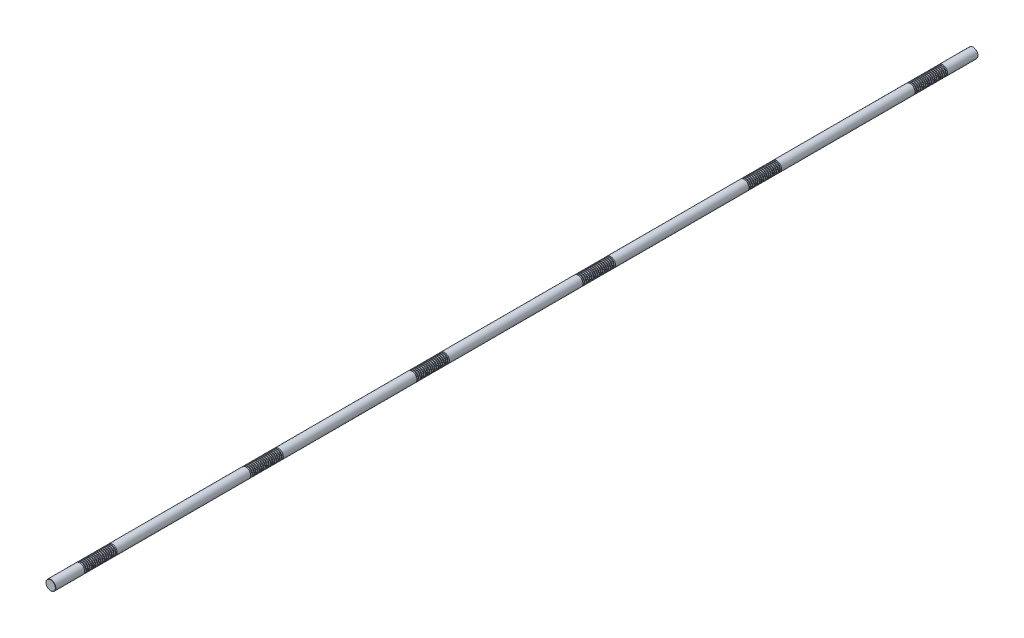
from build123d import *

# Parameters (mm, degrees)
SKETCH1_R           = 16
BOSS_EXTRUDE1_DEPTH = 1500
CHAMFER1_SIZE       = 0.8
LPATTERN1_COUNT     = 18
LPATTERN1_PITCH     = 6
LPATTERN2_COUNT     = 6
LPATTERN2_PITCH     = 540


with BuildPart() as part:
    # Sketch1 → Boss-Extrude1 (new, symmetric)
    with BuildSketch(Plane.XY):
        Circle(SKETCH1_R)
    extrude(amount=BOSS_EXTRUDE1_DEPTH, both=True)

    # Chamfer1
    chamfer1_edges = [part.edges().sort_by_distance(p)[0] for p in [
        (-16, 0, -1500),
        (-16, 0, 1500),
    ]]
    chamfer(chamfer1_edges, length=CHAMFER1_SIZE)

    # Sketch2 → Cut-Revolve1 (revolve, cut)
    with BuildSketch(Plane(origin=(0, 0, 0), x_dir=(0, 0, -1), z_dir=(1, 0, 0)), mode=Mode.PRIVATE) as cut_revolve1_sk:
        Polygon((1400.468911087, 16), (1396.531088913, 16), (1397.468911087, 12.5), (1399.531088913, 12.5), align=None)
    cut_revolve1 = revolve(cut_revolve1_sk.sketch.rotate(Axis((0, 0, 1500), (0, 0, -1)), 90), axis=Axis((0, 0, 1500), (0, 0, -1)), mode=Mode.SUBTRACT)

    # LPattern1: Cut-Revolve1 ×18
    with Locations(*[(0, 0, i * LPATTERN1_PITCH) for i in range(1, LPATTERN1_COUNT)]):
        add(cut_revolve1, mode=Mode.SUBTRACT)

    # LPattern2: Cut-Revolve1 ×6
    with Locations(*[(0, 0, i * LPATTERN2_PITCH) for i in range(1, LPATTERN2_COUNT)]):
        add(cut_revolve1, mode=Mode.SUBTRACT)

    # LPattern2 copy 1 sketch → LPattern2 copy 1 (revolve, cut)
    with BuildSketch(Plane(origin=(0, 0, 546), x_dir=(0, 0, -1), z_dir=(1, 0, 0))):
        Polygon((1400.468911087, 16), (1396.531088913, 16), (1397.468911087, 12.5), (1399.531088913, 12.5), align=None)
    revolve(axis=Axis((0, 0, 2046), (0, 0, -1)), mode=Mode.SUBTRACT)

    # LPattern2 copy 2 sketch → LPattern2 copy 2 (revolve, cut)
    with BuildSketch(Plane(origin=(0, 0, 1086), x_dir=(0, 0, -1), z_dir=(1, 0, 0))):
        Polygon((1400.468911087, 16), (1396.531088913, 16), (1397.468911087, 12.5), (1399.531088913, 12.5), align=None)
    revolve(axis=Axis((0, 0, 2586), (0, 0, -1)), mode=Mode.SUBTRACT)

    # LPattern2 copy 3 sketch → LPattern2 copy 3 (revolve, cut)
    with BuildSketch(Plane(origin=(0, 0, 1626), x_dir=(0, 0, -1), z_dir=(1, 0, 0))):
        Polygon((1400.468911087, 16), (1396.531088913, 16), (1397.468911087, 12.5), (1399.531088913, 12.5), align=None)
    revolve(axis=Axis((0, 0, 3126), (0, 0, -1)), mode=Mode.SUBTRACT)

    # LPattern2 copy 4 sketch → LPattern2 copy 4 (revolve, cut)
    with BuildSketch(Plane(origin=(0, 0, 2166), x_dir=(0, 0, -1), z_dir=(1, 0, 0))):
        Polygon((1400.468911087, 16), (1396.531088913, 16), (1397.468911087, 12.5), (1399.531088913, 12.5), align=None)
    revolve(axis=Axis((0, 0, 3666), (0, 0, -1)), mode=Mode.SUBTRACT)

    # LPattern2 copy 5 sketch → LPattern2 copy 5 (revolve, cut)
    with BuildSketch(Plane(origin=(0, 0, 2706), x_dir=(0, 0, -1), z_dir=(1, 0, 0))):
        Polygon((1400.468911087, 16), (1396.531088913, 16), (1397.468911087, 12.5), (1399.531088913, 12.5), align=None)
    revolve(axis=Axis((0, 0, 4206), (0, 0, -1)), mode=Mode.SUBTRACT)

    # LPattern2 copy 6 sketch → LPattern2 copy 6 (revolve, cut)
    with BuildSketch(Plane(origin=(0, 0, 552), x_dir=(0, 0, -1), z_dir=(1, 0, 0))):
        Polygon((1400.468911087, 16), (1396.531088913, 16), (1397.468911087, 12.5), (1399.531088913, 12.5), align=None)
    revolve(axis=Axis((0, 0, 2052), (0, 0, -1)), mode=Mode.SUBTRACT)

    # LPattern2 copy 7 sketch → LPattern2 copy 7 (revolve, cut)
    with BuildSketch(Plane(origin=(0, 0, 1092), x_dir=(0, 0, -1), z_dir=(1, 0, 0))):
        Polygon((1400.468911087, 16), (1396.531088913, 16), (1397.468911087, 12.5), (1399.531088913, 12.5), align=None)
    revolve(axis=Axis((0, 0, 2592), (0, 0, -1)), mode=Mode.SUBTRACT)

    # LPattern2 copy 8 sketch → LPattern2 copy 8 (revolve, cut)
    with BuildSketch(Plane(origin=(0, 0, 1632), x_dir=(0, 0, -1), z_dir=(1, 0, 0))):
        Polygon((1400.468911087, 16), (1396.531088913, 16), (1397.468911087, 12.5), (1399.531088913, 12.5), align=None)
    revolve(axis=Axis((0, 0, 3132), (0, 0, -1)), mode=Mode.SUBTRACT)

    # LPattern2 copy 9 sketch → LPattern2 copy 9 (revolve, cut)
    with BuildSketch(Plane(origin=(0, 0, 2172), x_dir=(0, 0, -1), z_dir=(1, 0, 0))):
        Polygon((1400.468911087, 16), (1396.531088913, 16), (1397.468911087, 12.5), (1399.531088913, 12.5), align=None)
    revolve(axis=Axis((0, 0, 3672), (0, 0, -1)), mode=Mode.SUBTRACT)

    # LPattern2 copy 10 sketch → LPattern2 copy 10 (revolve, cut)
    with BuildSketch(Plane(origin=(0, 0, 2712), x_dir=(0, 0, -1), z_dir=(1, 0, 0))):
        Polygon((1400.468911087, 16), (1396.531088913, 16), (1397.468911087, 12.5), (1399.531088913, 12.5), align=None)
    revolve(axis=Axis((0, 0, 4212), (0, 0, -1)), mode=Mode.SUBTRACT)

    # LPattern2 copy 11 sketch → LPattern2 copy 11 (revolve, cut)
    with BuildSketch(Plane(origin=(0, 0, 558), x_dir=(0, 0, -1), z_dir=(1, 0, 0))):
        Polygon((1400.468911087, 16), (1396.531088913, 16), (1397.468911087, 12.5), (1399.531088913, 12.5), align=None)
    revolve(axis=Axis((0, 0, 2058), (0, 0, -1)), mode=Mode.SUBTRACT)

    # LPattern2 copy 12 sketch → LPattern2 copy 12 (revolve, cut)
    with BuildSketch(Plane(origin=(0, 0, 1098), x_dir=(0, 0, -1), z_dir=(1, 0, 0))):
        Polygon((1400.468911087, 16), (1396.531088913, 16), (1397.468911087, 12.5), (1399.531088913, 12.5), align=None)
    revolve(axis=Axis((0, 0, 2598), (0, 0, -1)), mode=Mode.SUBTRACT)

    # LPattern2 copy 13 sketch → LPattern2 copy 13 (revolve, cut)
    with BuildSketch(Plane(origin=(0, 0, 1638), x_dir=(0, 0, -1), z_dir=(1, 0, 0))):
        Polygon((1400.468911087, 16), (1396.531088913, 16), (1397.468911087, 12.5), (1399.531088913, 12.5), align=None)
    revolve(axis=Axis((0, 0, 3138), (0, 0, -1)), mode=Mode.SUBTRACT)

    # LPattern2 copy 14 sketch → LPattern2 copy 14 (revolve, cut)
    with BuildSketch(Plane(origin=(0, 0, 2178), x_dir=(0, 0, -1), z_dir=(1, 0, 0))):
        Polygon((1400.468911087, 16), (1396.531088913, 16), (1397.468911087, 12.5), (1399.531088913, 12.5), align=None)
    revolve(axis=Axis((0, 0, 3678), (0, 0, -1)), mode=Mode.SUBTRACT)

    # LPattern2 copy 15 sketch → LPattern2 copy 15 (revolve, cut)
    with BuildSketch(Plane(origin=(0, 0, 2718), x_dir=(0, 0, -1), z_dir=(1, 0, 0))):
        Polygon((1400.468911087, 16), (1396.531088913, 16), (1397.468911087, 12.5), (1399.531088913, 12.5), align=None)
    revolve(axis=Axis((0, 0, 4218), (0, 0, -1)), mode=Mode.SUBTRACT)

    # LPattern2 copy 16 sketch → LPattern2 copy 16 (revolve, cut)
    with BuildSketch(Plane(origin=(0, 0, 564), x_dir=(0, 0, -1), z_dir=(1, 0, 0))):
        Polygon((1400.468911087, 16), (1396.531088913, 16), (1397.468911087, 12.5), (1399.531088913, 12.5), align=None)
    revolve(axis=Axis((0, 0, 2064), (0, 0, -1)), mode=Mode.SUBTRACT)

    # LPattern2 copy 17 sketch → LPattern2 copy 17 (revolve, cut)
    with BuildSketch(Plane(origin=(0, 0, 1104), x_dir=(0, 0, -1), z_dir=(1, 0, 0))):
        Polygon((1400.468911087, 16), (1396.531088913, 16), (1397.468911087, 12.5), (1399.531088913, 12.5), align=None)
    revolve(axis=Axis((0, 0, 2604), (0, 0, -1)), mode=Mode.SUBTRACT)

    # LPattern2 copy 18 sketch → LPattern2 copy 18 (revolve, cut)
    with BuildSketch(Plane(origin=(0, 0, 1644), x_dir=(0, 0, -1), z_dir=(1, 0, 0))):
        Polygon((1400.468911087, 16), (1396.531088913, 16), (1397.468911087, 12.5), (1399.531088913, 12.5), align=None)
    revolve(axis=Axis((0, 0, 3144), (0, 0, -1)), mode=Mode.SUBTRACT)

    # LPattern2 copy 19 sketch → LPattern2 copy 19 (revolve, cut)
    with BuildSketch(Plane(origin=(0, 0, 2184), x_dir=(0, 0, -1), z_dir=(1, 0, 0))):
        Polygon((1400.468911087, 16), (1396.531088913, 16), (1397.468911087, 12.5), (1399.531088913, 12.5), align=None)
    revolve(axis=Axis((0, 0, 3684), (0, 0, -1)), mode=Mode.SUBTRACT)

    # LPattern2 copy 20 sketch → LPattern2 copy 20 (revolve, cut)
    with BuildSketch(Plane(origin=(0, 0, 2724), x_dir=(0, 0, -1), z_dir=(1, 0, 0))):
        Polygon((1400.468911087, 16), (1396.531088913, 16), (1397.468911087, 12.5), (1399.531088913, 12.5), align=None)
    revolve(axis=Axis((0, 0, 4224), (0, 0, -1)), mode=Mode.SUBTRACT)

    # LPattern2 copy 21 sketch → LPattern2 copy 21 (revolve, cut)
    with BuildSketch(Plane(origin=(0, 0, 570), x_dir=(0, 0, -1), z_dir=(1, 0, 0))):
        Polygon((1400.468911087, 16), (1396.531088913, 16), (1397.468911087, 12.5), (1399.531088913, 12.5), align=None)
    revolve(axis=Axis((0, 0, 2070), (0, 0, -1)), mode=Mode.SUBTRACT)

    # LPattern2 copy 22 sketch → LPattern2 copy 22 (revolve, cut)
    with BuildSketch(Plane(origin=(0, 0, 1110), x_dir=(0, 0, -1), z_dir=(1, 0, 0))):
        Polygon((1400.468911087, 16), (1396.531088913, 16), (1397.468911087, 12.5), (1399.531088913, 12.5), align=None)
    revolve(axis=Axis((0, 0, 2610), (0, 0, -1)), mode=Mode.SUBTRACT)

    # LPattern2 copy 23 sketch → LPattern2 copy 23 (revolve, cut)
    with BuildSketch(Plane(origin=(0, 0, 1650), x_dir=(0, 0, -1), z_dir=(1, 0, 0))):
        Polygon((1400.468911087, 16), (1396.531088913, 16), (1397.468911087, 12.5), (1399.531088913, 12.5), align=None)
    revolve(axis=Axis((0, 0, 3150), (0, 0, -1)), mode=Mode.SUBTRACT)

    # LPattern2 copy 24 sketch → LPattern2 copy 24 (revolve, cut)
    with BuildSketch(Plane(origin=(0, 0, 2190), x_dir=(0, 0, -1), z_dir=(1, 0, 0))):
        Polygon((1400.468911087, 16), (1396.531088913, 16), (1397.468911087, 12.5), (1399.531088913, 12.5), align=None)
    revolve(axis=Axis((0, 0, 3690), (0, 0, -1)), mode=Mode.SUBTRACT)

    # LPattern2 copy 25 sketch → LPattern2 copy 25 (revolve, cut)
    with BuildSketch(Plane(origin=(0, 0, 2730), x_dir=(0, 0, -1), z_dir=(1, 0, 0))):
        Polygon((1400.468911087, 16), (1396.531088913, 16), (1397.468911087, 12.5), (1399.531088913, 12.5), align=None)
    revolve(axis=Axis((0, 0, 4230), (0, 0, -1)), mode=Mode.SUBTRACT)

    # LPattern2 copy 26 sketch → LPattern2 copy 26 (revolve, cut)
    with BuildSketch(Plane(origin=(0, 0, 576), x_dir=(0, 0, -1), z_dir=(1, 0, 0))):
        Polygon((1400.468911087, 16), (1396.531088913, 16), (1397.468911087, 12.5), (1399.531088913, 12.5), align=None)
    revolve(axis=Axis((0, 0, 2076), (0, 0, -1)), mode=Mode.SUBTRACT)

    # LPattern2 copy 27 sketch → LPattern2 copy 27 (revolve, cut)
    with BuildSketch(Plane(origin=(0, 0, 1116), x_dir=(0, 0, -1), z_dir=(1, 0, 0))):
        Polygon((1400.468911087, 16), (1396.531088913, 16), (1397.468911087, 12.5), (1399.531088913, 12.5), align=None)
    revolve(axis=Axis((0, 0, 2616), (0, 0, -1)), mode=Mode.SUBTRACT)

    # LPattern2 copy 28 sketch → LPattern2 copy 28 (revolve, cut)
    with BuildSketch(Plane(origin=(0, 0, 1656), x_dir=(0, 0, -1), z_dir=(1, 0, 0))):
        Polygon((1400.468911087, 16), (1396.531088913, 16), (1397.468911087, 12.5), (1399.531088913, 12.5), align=None)
    revolve(axis=Axis((0, 0, 3156), (0, 0, -1)), mode=Mode.SUBTRACT)

    # LPattern2 copy 29 sketch → LPattern2 copy 29 (revolve, cut)
    with BuildSketch(Plane(origin=(0, 0, 2196), x_dir=(0, 0, -1), z_dir=(1, 0, 0))):
        Polygon((1400.468911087, 16), (1396.531088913, 16), (1397.468911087, 12.5), (1399.531088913, 12.5), align=None)
    revolve(axis=Axis((0, 0, 3696), (0, 0, -1)), mode=Mode.SUBTRACT)

    # LPattern2 copy 30 sketch → LPattern2 copy 30 (revolve, cut)
    with BuildSketch(Plane(origin=(0, 0, 2736), x_dir=(0, 0, -1), z_dir=(1, 0, 0))):
        Polygon((1400.468911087, 16), (1396.531088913, 16), (1397.468911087, 12.5), (1399.531088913, 12.5), align=None)
    revolve(axis=Axis((0, 0, 4236), (0, 0, -1)), mode=Mode.SUBTRACT)

    # LPattern2 copy 31 sketch → LPattern2 copy 31 (revolve, cut)
    with BuildSketch(Plane(origin=(0, 0, 582), x_dir=(0, 0, -1), z_dir=(1, 0, 0))):
        Polygon((1400.468911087, 16), (1396.531088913, 16), (1397.468911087, 12.5), (1399.531088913, 12.5), align=None)
    revolve(axis=Axis((0, 0, 2082), (0, 0, -1)), mode=Mode.SUBTRACT)

    # LPattern2 copy 32 sketch → LPattern2 copy 32 (revolve, cut)
    with BuildSketch(Plane(origin=(0, 0, 1122), x_dir=(0, 0, -1), z_dir=(1, 0, 0))):
        Polygon((1400.468911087, 16), (1396.531088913, 16), (1397.468911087, 12.5), (1399.531088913, 12.5), align=None)
    revolve(axis=Axis((0, 0, 2622), (0, 0, -1)), mode=Mode.SUBTRACT)

    # LPattern2 copy 33 sketch → LPattern2 copy 33 (revolve, cut)
    with BuildSketch(Plane(origin=(0, 0, 1662), x_dir=(0, 0, -1), z_dir=(1, 0, 0))):
        Polygon((1400.468911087, 16), (1396.531088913, 16), (1397.468911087, 12.5), (1399.531088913, 12.5), align=None)
    revolve(axis=Axis((0, 0, 3162), (0, 0, -1)), mode=Mode.SUBTRACT)

    # LPattern2 copy 34 sketch → LPattern2 copy 34 (revolve, cut)
    with BuildSketch(Plane(origin=(0, 0, 2202), x_dir=(0, 0, -1), z_dir=(1, 0, 0))):
        Polygon((1400.468911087, 16), (1396.531088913, 16), (1397.468911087, 12.5), (1399.531088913, 12.5), align=None)
    revolve(axis=Axis((0, 0, 3702), (0, 0, -1)), mode=Mode.SUBTRACT)

    # LPattern2 copy 35 sketch → LPattern2 copy 35 (revolve, cut)
    with BuildSketch(Plane(origin=(0, 0, 2742), x_dir=(0, 0, -1), z_dir=(1, 0, 0))):
        Polygon((1400.468911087, 16), (1396.531088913, 16), (1397.468911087, 12.5), (1399.531088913, 12.5), align=None)
    revolve(axis=Axis((0, 0, 4242), (0, 0, -1)), mode=Mode.SUBTRACT)

    # LPattern2 copy 36 sketch → LPattern2 copy 36 (revolve, cut)
    with BuildSketch(Plane(origin=(0, 0, 588), x_dir=(0, 0, -1), z_dir=(1, 0, 0))):
        Polygon((1400.468911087, 16), (1396.531088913, 16), (1397.468911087, 12.5), (1399.531088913, 12.5), align=None)
    revolve(axis=Axis((0, 0, 2088), (0, 0, -1)), mode=Mode.SUBTRACT)

    # LPattern2 copy 37 sketch → LPattern2 copy 37 (revolve, cut)
    with BuildSketch(Plane(origin=(0, 0, 1128), x_dir=(0, 0, -1), z_dir=(1, 0, 0))):
        Polygon((1400.468911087, 16), (1396.531088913, 16), (1397.468911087, 12.5), (1399.531088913, 12.5), align=None)
    revolve(axis=Axis((0, 0, 2628), (0, 0, -1)), mode=Mode.SUBTRACT)

    # LPattern2 copy 38 sketch → LPattern2 copy 38 (revolve, cut)
    with BuildSketch(Plane(origin=(0, 0, 1668), x_dir=(0, 0, -1), z_dir=(1, 0, 0))):
        Polygon((1400.468911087, 16), (1396.531088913, 16), (1397.468911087, 12.5), (1399.531088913, 12.5), align=None)
    revolve(axis=Axis((0, 0, 3168), (0, 0, -1)), mode=Mode.SUBTRACT)

    # LPattern2 copy 39 sketch → LPattern2 copy 39 (revolve, cut)
    with BuildSketch(Plane(origin=(0, 0, 2208), x_dir=(0, 0, -1), z_dir=(1, 0, 0))):
        Polygon((1400.468911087, 16), (1396.531088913, 16), (1397.468911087, 12.5), (1399.531088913, 12.5), align=None)
    revolve(axis=Axis((0, 0, 3708), (0, 0, -1)), mode=Mode.SUBTRACT)

    # LPattern2 copy 40 sketch → LPattern2 copy 40 (revolve, cut)
    with BuildSketch(Plane(origin=(0, 0, 2748), x_dir=(0, 0, -1), z_dir=(1, 0, 0))):
        Polygon((1400.468911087, 16), (1396.531088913, 16), (1397.468911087, 12.5), (1399.531088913, 12.5), align=None)
    revolve(axis=Axis((0, 0, 4248), (0, 0, -1)), mode=Mode.SUBTRACT)

    # LPattern2 copy 41 sketch → LPattern2 copy 41 (revolve, cut)
    with BuildSketch(Plane(origin=(0, 0, 594), x_dir=(0, 0, -1), z_dir=(1, 0, 0))):
        Polygon((1400.468911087, 16), (1396.531088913, 16), (1397.468911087, 12.5), (1399.531088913, 12.5), align=None)
    revolve(axis=Axis((0, 0, 2094), (0, 0, -1)), mode=Mode.SUBTRACT)

    # LPattern2 copy 42 sketch → LPattern2 copy 42 (revolve, cut)
    with BuildSketch(Plane(origin=(0, 0, 1134), x_dir=(0, 0, -1), z_dir=(1, 0, 0))):
        Polygon((1400.468911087, 16), (1396.531088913, 16), (1397.468911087, 12.5), (1399.531088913, 12.5), align=None)
    revolve(axis=Axis((0, 0, 2634), (0, 0, -1)), mode=Mode.SUBTRACT)

    # LPattern2 copy 43 sketch → LPattern2 copy 43 (revolve, cut)
    with BuildSketch(Plane(origin=(0, 0, 1674), x_dir=(0, 0, -1), z_dir=(1, 0, 0))):
        Polygon((1400.468911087, 16), (1396.531088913, 16), (1397.468911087, 12.5), (1399.531088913, 12.5), align=None)
    revolve(axis=Axis((0, 0, 3174), (0, 0, -1)), mode=Mode.SUBTRACT)

    # LPattern2 copy 44 sketch → LPattern2 copy 44 (revolve, cut)
    with BuildSketch(Plane(origin=(0, 0, 2214), x_dir=(0, 0, -1), z_dir=(1, 0, 0))):
        Polygon((1400.468911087, 16), (1396.531088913, 16), (1397.468911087, 12.5), (1399.531088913, 12.5), align=None)
    revolve(axis=Axis((0, 0, 3714), (0, 0, -1)), mode=Mode.SUBTRACT)

    # LPattern2 copy 45 sketch → LPattern2 copy 45 (revolve, cut)
    with BuildSketch(Plane(origin=(0, 0, 2754), x_dir=(0, 0, -1), z_dir=(1, 0, 0))):
        Polygon((1400.468911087, 16), (1396.531088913, 16), (1397.468911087, 12.5), (1399.531088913, 12.5), align=None)
    revolve(axis=Axis((0, 0, 4254), (0, 0, -1)), mode=Mode.SUBTRACT)

    # LPattern2 copy 46 sketch → LPattern2 copy 46 (revolve, cut)
    with BuildSketch(Plane(origin=(0, 0, 600), x_dir=(0, 0, -1), z_dir=(1, 0, 0))):
        Polygon((1400.468911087, 16), (1396.531088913, 16), (1397.468911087, 12.5), (1399.531088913, 12.5), align=None)
    revolve(axis=Axis((0, 0, 2100), (0, 0, -1)), mode=Mode.SUBTRACT)

    # LPattern2 copy 47 sketch → LPattern2 copy 47 (revolve, cut)
    with BuildSketch(Plane(origin=(0, 0, 1140), x_dir=(0, 0, -1), z_dir=(1, 0, 0))):
        Polygon((1400.468911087, 16), (1396.531088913, 16), (1397.468911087, 12.5), (1399.531088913, 12.5), align=None)
    revolve(axis=Axis((0, 0, 2640), (0, 0, -1)), mode=Mode.SUBTRACT)

    # LPattern2 copy 48 sketch → LPattern2 copy 48 (revolve, cut)
    with BuildSketch(Plane(origin=(0, 0, 1680), x_dir=(0, 0, -1), z_dir=(1, 0, 0))):
        Polygon((1400.468911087, 16), (1396.531088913, 16), (1397.468911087, 12.5), (1399.531088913, 12.5), align=None)
    revolve(axis=Axis((0, 0, 3180), (0, 0, -1)), mode=Mode.SUBTRACT)

    # LPattern2 copy 49 sketch → LPattern2 copy 49 (revolve, cut)
    with BuildSketch(Plane(origin=(0, 0, 2220), x_dir=(0, 0, -1), z_dir=(1, 0, 0))):
        Polygon((1400.468911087, 16), (1396.531088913, 16), (1397.468911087, 12.5), (1399.531088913, 12.5), align=None)
    revolve(axis=Axis((0, 0, 3720), (0, 0, -1)), mode=Mode.SUBTRACT)

    # LPattern2 copy 50 sketch → LPattern2 copy 50 (revolve, cut)
    with BuildSketch(Plane(origin=(0, 0, 2760), x_dir=(0, 0, -1), z_dir=(1, 0, 0))):
        Polygon((1400.468911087, 16), (1396.531088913, 16), (1397.468911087, 12.5), (1399.531088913, 12.5), align=None)
    revolve(axis=Axis((0, 0, 4260), (0, 0, -1)), mode=Mode.SUBTRACT)

    # LPattern2 copy 51 sketch → LPattern2 copy 51 (revolve, cut)
    with BuildSketch(Plane(origin=(0, 0, 606), x_dir=(0, 0, -1), z_dir=(1, 0, 0))):
        Polygon((1400.468911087, 16), (1396.531088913, 16), (1397.468911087, 12.5), (1399.531088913, 12.5), align=None)
    revolve(axis=Axis((0, 0, 2106), (0, 0, -1)), mode=Mode.SUBTRACT)

    # LPattern2 copy 52 sketch → LPattern2 copy 52 (revolve, cut)
    with BuildSketch(Plane(origin=(0, 0, 1146), x_dir=(0, 0, -1), z_dir=(1, 0, 0))):
        Polygon((1400.468911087, 16), (1396.531088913, 16), (1397.468911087, 12.5), (1399.531088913, 12.5), align=None)
    revolve(axis=Axis((0, 0, 2646), (0, 0, -1)), mode=Mode.SUBTRACT)

    # LPattern2 copy 53 sketch → LPattern2 copy 53 (revolve, cut)
    with BuildSketch(Plane(origin=(0, 0, 1686), x_dir=(0, 0, -1), z_dir=(1, 0, 0))):
        Polygon((1400.468911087, 16), (1396.531088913, 16), (1397.468911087, 12.5), (1399.531088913, 12.5), align=None)
    revolve(axis=Axis((0, 0, 3186), (0, 0, -1)), mode=Mode.SUBTRACT)

    # LPattern2 copy 54 sketch → LPattern2 copy 54 (revolve, cut)
    with BuildSketch(Plane(origin=(0, 0, 2226), x_dir=(0, 0, -1), z_dir=(1, 0, 0))):
        Polygon((1400.468911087, 16), (1396.531088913, 16), (1397.468911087, 12.5), (1399.531088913, 12.5), align=None)
    revolve(axis=Axis((0, 0, 3726), (0, 0, -1)), mode=Mode.SUBTRACT)

    # LPattern2 copy 55 sketch → LPattern2 copy 55 (revolve, cut)
    with BuildSketch(Plane(origin=(0, 0, 2766), x_dir=(0, 0, -1), z_dir=(1, 0, 0))):
        Polygon((1400.468911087, 16), (1396.531088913, 16), (1397.468911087, 12.5), (1399.531088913, 12.5), align=None)
    revolve(axis=Axis((0, 0, 4266), (0, 0, -1)), mode=Mode.SUBTRACT)

    # LPattern2 copy 56 sketch → LPattern2 copy 56 (revolve, cut)
    with BuildSketch(Plane(origin=(0, 0, 612), x_dir=(0, 0, -1), z_dir=(1, 0, 0))):
        Polygon((1400.468911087, 16), (1396.531088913, 16), (1397.468911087, 12.5), (1399.531088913, 12.5), align=None)
    revolve(axis=Axis((0, 0, 2112), (0, 0, -1)), mode=Mode.SUBTRACT)

    # LPattern2 copy 57 sketch → LPattern2 copy 57 (revolve, cut)
    with BuildSketch(Plane(origin=(0, 0, 1152), x_dir=(0, 0, -1), z_dir=(1, 0, 0))):
        Polygon((1400.468911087, 16), (1396.531088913, 16), (1397.468911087, 12.5), (1399.531088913, 12.5), align=None)
    revolve(axis=Axis((0, 0, 2652), (0, 0, -1)), mode=Mode.SUBTRACT)

    # LPattern2 copy 58 sketch → LPattern2 copy 58 (revolve, cut)
    with BuildSketch(Plane(origin=(0, 0, 1692), x_dir=(0, 0, -1), z_dir=(1, 0, 0))):
        Polygon((1400.468911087, 16), (1396.531088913, 16), (1397.468911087, 12.5), (1399.531088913, 12.5), align=None)
    revolve(axis=Axis((0, 0, 3192), (0, 0, -1)), mode=Mode.SUBTRACT)

    # LPattern2 copy 59 sketch → LPattern2 copy 59 (revolve, cut)
    with BuildSketch(Plane(origin=(0, 0, 2232), x_dir=(0, 0, -1), z_dir=(1, 0, 0))):
        Polygon((1400.468911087, 16), (1396.531088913, 16), (1397.468911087, 12.5), (1399.531088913, 12.5), align=None)
    revolve(axis=Axis((0, 0, 3732), (0, 0, -1)), mode=Mode.SUBTRACT)

    # LPattern2 copy 60 sketch → LPattern2 copy 60 (revolve, cut)
    with BuildSketch(Plane(origin=(0, 0, 2772), x_dir=(0, 0, -1), z_dir=(1, 0, 0))):
        Polygon((1400.468911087, 16), (1396.531088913, 16), (1397.468911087, 12.5), (1399.531088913, 12.5), align=None)
    revolve(axis=Axis((0, 0, 4272), (0, 0, -1)), mode=Mode.SUBTRACT)

    # LPattern2 copy 61 sketch → LPattern2 copy 61 (revolve, cut)
    with BuildSketch(Plane(origin=(0, 0, 618), x_dir=(0, 0, -1), z_dir=(1, 0, 0))):
        Polygon((1400.468911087, 16), (1396.531088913, 16), (1397.468911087, 12.5), (1399.531088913, 12.5), align=None)
    revolve(axis=Axis((0, 0, 2118), (0, 0, -1)), mode=Mode.SUBTRACT)

    # LPattern2 copy 62 sketch → LPattern2 copy 62 (revolve, cut)
    with BuildSketch(Plane(origin=(0, 0, 1158), x_dir=(0, 0, -1), z_dir=(1, 0, 0))):
        Polygon((1400.468911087, 16), (1396.531088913, 16), (1397.468911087, 12.5), (1399.531088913, 12.5), align=None)
    revolve(axis=Axis((0, 0, 2658), (0, 0, -1)), mode=Mode.SUBTRACT)

    # LPattern2 copy 63 sketch → LPattern2 copy 63 (revolve, cut)
    with BuildSketch(Plane(origin=(0, 0, 1698), x_dir=(0, 0, -1), z_dir=(1, 0, 0))):
        Polygon((1400.468911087, 16), (1396.531088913, 16), (1397.468911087, 12.5), (1399.531088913, 12.5), align=None)
    revolve(axis=Axis((0, 0, 3198), (0, 0, -1)), mode=Mode.SUBTRACT)

    # LPattern2 copy 64 sketch → LPattern2 copy 64 (revolve, cut)
    with BuildSketch(Plane(origin=(0, 0, 2238), x_dir=(0, 0, -1), z_dir=(1, 0, 0))):
        Polygon((1400.468911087, 16), (1396.531088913, 16), (1397.468911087, 12.5), (1399.531088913, 12.5), align=None)
    revolve(axis=Axis((0, 0, 3738), (0, 0, -1)), mode=Mode.SUBTRACT)

    # LPattern2 copy 65 sketch → LPattern2 copy 65 (revolve, cut)
    with BuildSketch(Plane(origin=(0, 0, 2778), x_dir=(0, 0, -1), z_dir=(1, 0, 0))):
        Polygon((1400.468911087, 16), (1396.531088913, 16), (1397.468911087, 12.5), (1399.531088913, 12.5), align=None)
    revolve(axis=Axis((0, 0, 4278), (0, 0, -1)), mode=Mode.SUBTRACT)

    # LPattern2 copy 66 sketch → LPattern2 copy 66 (revolve, cut)
    with BuildSketch(Plane(origin=(0, 0, 624), x_dir=(0, 0, -1), z_dir=(1, 0, 0))):
        Polygon((1400.468911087, 16), (1396.531088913, 16), (1397.468911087, 12.5), (1399.531088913, 12.5), align=None)
    revolve(axis=Axis((0, 0, 2124), (0, 0, -1)), mode=Mode.SUBTRACT)

    # LPattern2 copy 67 sketch → LPattern2 copy 67 (revolve, cut)
    with BuildSketch(Plane(origin=(0, 0, 1164), x_dir=(0, 0, -1), z_dir=(1, 0, 0))):
        Polygon((1400.468911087, 16), (1396.531088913, 16), (1397.468911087, 12.5), (1399.531088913, 12.5), align=None)
    revolve(axis=Axis((0, 0, 2664), (0, 0, -1)), mode=Mode.SUBTRACT)

    # LPattern2 copy 68 sketch → LPattern2 copy 68 (revolve, cut)
    with BuildSketch(Plane(origin=(0, 0, 1704), x_dir=(0, 0, -1), z_dir=(1, 0, 0))):
        Polygon((1400.468911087, 16), (1396.531088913, 16), (1397.468911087, 12.5), (1399.531088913, 12.5), align=None)
    revolve(axis=Axis((0, 0, 3204), (0, 0, -1)), mode=Mode.SUBTRACT)

    # LPattern2 copy 69 sketch → LPattern2 copy 69 (revolve, cut)
    with BuildSketch(Plane(origin=(0, 0, 2244), x_dir=(0, 0, -1), z_dir=(1, 0, 0))):
        Polygon((1400.468911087, 16), (1396.531088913, 16), (1397.468911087, 12.5), (1399.531088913, 12.5), align=None)
    revolve(axis=Axis((0, 0, 3744), (0, 0, -1)), mode=Mode.SUBTRACT)

    # LPattern2 copy 70 sketch → LPattern2 copy 70 (revolve, cut)
    with BuildSketch(Plane(origin=(0, 0, 2784), x_dir=(0, 0, -1), z_dir=(1, 0, 0))):
        Polygon((1400.468911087, 16), (1396.531088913, 16), (1397.468911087, 12.5), (1399.531088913, 12.5), align=None)
    revolve(axis=Axis((0, 0, 4284), (0, 0, -1)), mode=Mode.SUBTRACT)

    # LPattern2 copy 71 sketch → LPattern2 copy 71 (revolve, cut)
    with BuildSketch(Plane(origin=(0, 0, 630), x_dir=(0, 0, -1), z_dir=(1, 0, 0))):
        Polygon((1400.468911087, 16), (1396.531088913, 16), (1397.468911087, 12.5), (1399.531088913, 12.5), align=None)
    revolve(axis=Axis((0, 0, 2130), (0, 0, -1)), mode=Mode.SUBTRACT)

    # LPattern2 copy 72 sketch → LPattern2 copy 72 (revolve, cut)
    with BuildSketch(Plane(origin=(0, 0, 1170), x_dir=(0, 0, -1), z_dir=(1, 0, 0))):
        Polygon((1400.468911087, 16), (1396.531088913, 16), (1397.468911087, 12.5), (1399.531088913, 12.5), align=None)
    revolve(axis=Axis((0, 0, 2670), (0, 0, -1)), mode=Mode.SUBTRACT)

    # LPattern2 copy 73 sketch → LPattern2 copy 73 (revolve, cut)
    with BuildSketch(Plane(origin=(0, 0, 1710), x_dir=(0, 0, -1), z_dir=(1, 0, 0))):
        Polygon((1400.468911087, 16), (1396.531088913, 16), (1397.468911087, 12.5), (1399.531088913, 12.5), align=None)
    revolve(axis=Axis((0, 0, 3210), (0, 0, -1)), mode=Mode.SUBTRACT)

    # LPattern2 copy 74 sketch → LPattern2 copy 74 (revolve, cut)
    with BuildSketch(Plane(origin=(0, 0, 2250), x_dir=(0, 0, -1), z_dir=(1, 0, 0))):
        Polygon((1400.468911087, 16), (1396.531088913, 16), (1397.468911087, 12.5), (1399.531088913, 12.5), align=None)
    revolve(axis=Axis((0, 0, 3750), (0, 0, -1)), mode=Mode.SUBTRACT)

    # LPattern2 copy 75 sketch → LPattern2 copy 75 (revolve, cut)
    with BuildSketch(Plane(origin=(0, 0, 2790), x_dir=(0, 0, -1), z_dir=(1, 0, 0))):
        Polygon((1400.468911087, 16), (1396.531088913, 16), (1397.468911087, 12.5), (1399.531088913, 12.5), align=None)
    revolve(axis=Axis((0, 0, 4290), (0, 0, -1)), mode=Mode.SUBTRACT)

    # LPattern2 copy 76 sketch → LPattern2 copy 76 (revolve, cut)
    with BuildSketch(Plane(origin=(0, 0, 636), x_dir=(0, 0, -1), z_dir=(1, 0, 0))):
        Polygon((1400.468911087, 16), (1396.531088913, 16), (1397.468911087, 12.5), (1399.531088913, 12.5), align=None)
    revolve(axis=Axis((0, 0, 2136), (0, 0, -1)), mode=Mode.SUBTRACT)

    # LPattern2 copy 77 sketch → LPattern2 copy 77 (revolve, cut)
    with BuildSketch(Plane(origin=(0, 0, 1176), x_dir=(0, 0, -1), z_dir=(1, 0, 0))):
        Polygon((1400.468911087, 16), (1396.531088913, 16), (1397.468911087, 12.5), (1399.531088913, 12.5), align=None)
    revolve(axis=Axis((0, 0, 2676), (0, 0, -1)), mode=Mode.SUBTRACT)

    # LPattern2 copy 78 sketch → LPattern2 copy 78 (revolve, cut)
    with BuildSketch(Plane(origin=(0, 0, 1716), x_dir=(0, 0, -1), z_dir=(1, 0, 0))):
        Polygon((1400.468911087, 16), (1396.531088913, 16), (1397.468911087, 12.5), (1399.531088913, 12.5), align=None)
    revolve(axis=Axis((0, 0, 3216), (0, 0, -1)), mode=Mode.SUBTRACT)

    # LPattern2 copy 79 sketch → LPattern2 copy 79 (revolve, cut)
    with BuildSketch(Plane(origin=(0, 0, 2256), x_dir=(0, 0, -1), z_dir=(1, 0, 0))):
        Polygon((1400.468911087, 16), (1396.531088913, 16), (1397.468911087, 12.5), (1399.531088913, 12.5), align=None)
    revolve(axis=Axis((0, 0, 3756), (0, 0, -1)), mode=Mode.SUBTRACT)

    # LPattern2 copy 80 sketch → LPattern2 copy 80 (revolve, cut)
    with BuildSketch(Plane(origin=(0, 0, 2796), x_dir=(0, 0, -1), z_dir=(1, 0, 0))):
        Polygon((1400.468911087, 16), (1396.531088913, 16), (1397.468911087, 12.5), (1399.531088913, 12.5), align=None)
    revolve(axis=Axis((0, 0, 4296), (0, 0, -1)), mode=Mode.SUBTRACT)

    # LPattern2 copy 81 sketch → LPattern2 copy 81 (revolve, cut)
    with BuildSketch(Plane(origin=(0, 0, 642), x_dir=(0, 0, -1), z_dir=(1, 0, 0))):
        Polygon((1400.468911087, 16), (1396.531088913, 16), (1397.468911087, 12.5), (1399.531088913, 12.5), align=None)
    revolve(axis=Axis((0, 0, 2142), (0, 0, -1)), mode=Mode.SUBTRACT)

    # LPattern2 copy 82 sketch → LPattern2 copy 82 (revolve, cut)
    with BuildSketch(Plane(origin=(0, 0, 1182), x_dir=(0, 0, -1), z_dir=(1, 0, 0))):
        Polygon((1400.468911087, 16), (1396.531088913, 16), (1397.468911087, 12.5), (1399.531088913, 12.5), align=None)
    revolve(axis=Axis((0, 0, 2682), (0, 0, -1)), mode=Mode.SUBTRACT)

    # LPattern2 copy 83 sketch → LPattern2 copy 83 (revolve, cut)
    with BuildSketch(Plane(origin=(0, 0, 1722), x_dir=(0, 0, -1), z_dir=(1, 0, 0))):
        Polygon((1400.468911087, 16), (1396.531088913, 16), (1397.468911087, 12.5), (1399.531088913, 12.5), align=None)
    revolve(axis=Axis((0, 0, 3222), (0, 0, -1)), mode=Mode.SUBTRACT)

    # LPattern2 copy 84 sketch → LPattern2 copy 84 (revolve, cut)
    with BuildSketch(Plane(origin=(0, 0, 2262), x_dir=(0, 0, -1), z_dir=(1, 0, 0))):
        Polygon((1400.468911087, 16), (1396.531088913, 16), (1397.468911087, 12.5), (1399.531088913, 12.5), align=None)
    revolve(axis=Axis((0, 0, 3762), (0, 0, -1)), mode=Mode.SUBTRACT)

    # LPattern2 copy 85 sketch → LPattern2 copy 85 (revolve, cut)
    with BuildSketch(Plane(origin=(0, 0, 2802), x_dir=(0, 0, -1), z_dir=(1, 0, 0))):
        Polygon((1400.468911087, 16), (1396.531088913, 16), (1397.468911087, 12.5), (1399.531088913, 12.5), align=None)
    revolve(axis=Axis((0, 0, 4302), (0, 0, -1)), mode=Mode.SUBTRACT)


solid = part.part
